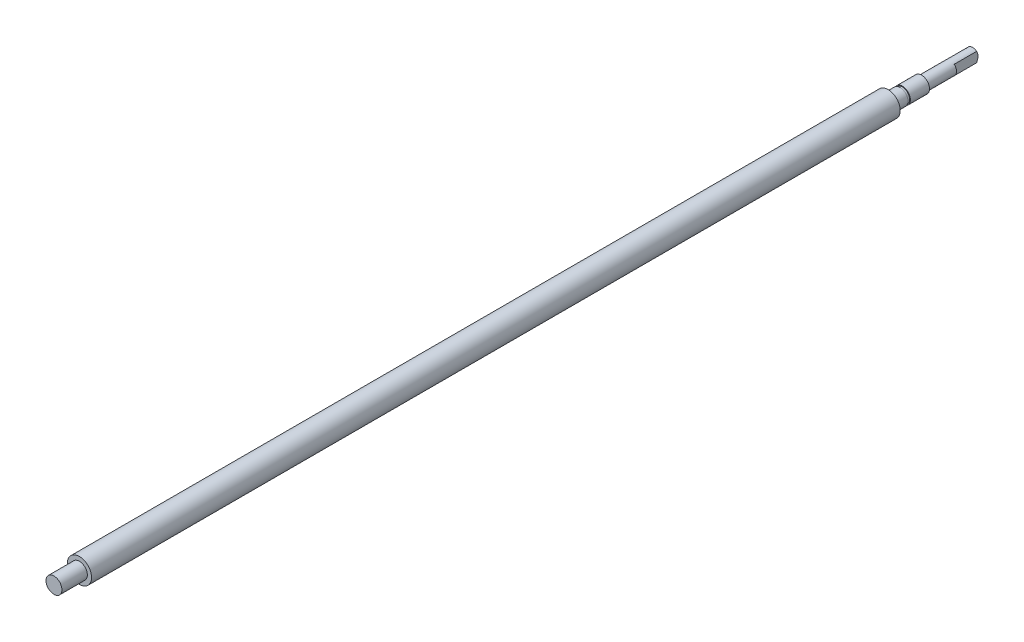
ISO-10303-21;
HEADER;
FILE_DESCRIPTION(('STEP AP214'),'2;1');
FILE_NAME('part.step','',(''),(''),'','','');
FILE_SCHEMA(('AUTOMOTIVE_DESIGN { 1 0 10303 214 1 1 1 1 }'));
ENDSEC;
DATA;
#1=APPLICATION_CONTEXT('core data for automotive mechanical design processes');
#2=APPLICATION_PROTOCOL_DEFINITION('international standard','automotive_design',2000,#1);
#3=PRODUCT_CONTEXT('',#1,'mechanical');
#4=PRODUCT('Part','Part','',(#3));
#5=PRODUCT_RELATED_PRODUCT_CATEGORY('part','',(#4));
#6=PRODUCT_DEFINITION_FORMATION('','',#4);
#7=PRODUCT_DEFINITION_CONTEXT('part definition',#1,'design');
#8=PRODUCT_DEFINITION('design','',#6,#7);
#9=PRODUCT_DEFINITION_SHAPE('','',#8);
#10=(LENGTH_UNIT() NAMED_UNIT(*) SI_UNIT(.MILLI.,.METRE.));
#11=(NAMED_UNIT(*) PLANE_ANGLE_UNIT() SI_UNIT($,.RADIAN.));
#12=(NAMED_UNIT(*) SI_UNIT($,.STERADIAN.) SOLID_ANGLE_UNIT());
#13=UNCERTAINTY_MEASURE_WITH_UNIT(LENGTH_MEASURE(1.E-05),#10,'distance_accuracy_value','');
#14=(GEOMETRIC_REPRESENTATION_CONTEXT(3) GLOBAL_UNCERTAINTY_ASSIGNED_CONTEXT((#13)) GLOBAL_UNIT_ASSIGNED_CONTEXT((#10,
#11,#12)) REPRESENTATION_CONTEXT('',''));
#15=CARTESIAN_POINT('',(0.,0.,0.));
#16=DIRECTION('',(0.,0.,1.));
#17=DIRECTION('',(1.,0.,0.));
#18=AXIS2_PLACEMENT_3D('',#15,#16,#17);
#19=CARTESIAN_POINT('',(0.,0.,-21.5));
#20=DIRECTION('',(0.,0.,-1.));
#21=DIRECTION('',(-1.,0.,0.));
#22=AXIS2_PLACEMENT_3D('',#19,#20,#21);
#23=PLANE('',#22);
#24=CARTESIAN_POINT('',(0.,0.,-21.5));
#25=DIRECTION('',(0.,0.,-1.));
#26=DIRECTION('',(-1.,0.,0.));
#27=AXIS2_PLACEMENT_3D('',#24,#25,#26);
#28=CIRCLE('',#27,4.13397459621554);
#29=CARTESIAN_POINT('',(-4.13397459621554,0.,-21.5));
#30=VERTEX_POINT('',#29);
#31=EDGE_CURVE('E123',#30,#30,#28,.T.);
#32=ORIENTED_EDGE('',*,*,#31,.T.);
#33=EDGE_LOOP('',(#32));
#34=FACE_BOUND('',#33,.T.);
#35=CARTESIAN_POINT('',(0.,0.,-21.5));
#36=DIRECTION('',(0.,0.,-1.));
#37=DIRECTION('',(-1.,0.,0.));
#38=AXIS2_PLACEMENT_3D('',#35,#36,#37);
#39=CIRCLE('',#38,4.);
#40=CARTESIAN_POINT('',(-4.,0.,-21.5));
#41=VERTEX_POINT('',#40);
#42=EDGE_CURVE('E93',#41,#41,#39,.T.);
#43=ORIENTED_EDGE('',*,*,#42,.F.);
#44=EDGE_LOOP('',(#43));
#45=FACE_BOUND('',#44,.T.);
#46=ADVANCED_FACE('F29',(#34,#45),#23,.T.);
#47=CARTESIAN_POINT('',(0.,0.,-7.5));
#48=DIRECTION('',(0.,0.,-1.));
#49=DIRECTION('',(-1.,0.,0.));
#50=AXIS2_PLACEMENT_3D('',#47,#48,#49);
#51=PLANE('',#50);
#52=CARTESIAN_POINT('',(0.,0.,-7.5));
#53=DIRECTION('',(0.,0.,-1.));
#54=DIRECTION('',(-1.,0.,0.));
#55=AXIS2_PLACEMENT_3D('',#52,#53,#54);
#56=CIRCLE('',#55,5.);
#57=CARTESIAN_POINT('',(-5.,0.,-7.5));
#58=VERTEX_POINT('',#57);
#59=EDGE_CURVE('E105',#58,#58,#56,.T.);
#60=ORIENTED_EDGE('',*,*,#59,.T.);
#61=EDGE_LOOP('',(#60));
#62=FACE_BOUND('',#61,.T.);
#63=CARTESIAN_POINT('',(0.,0.,-7.5));
#64=DIRECTION('',(0.,0.,-1.));
#65=DIRECTION('',(-1.,0.,0.));
#66=AXIS2_PLACEMENT_3D('',#63,#64,#65);
#67=CIRCLE('',#66,4.5);
#68=CARTESIAN_POINT('',(-4.5,0.,-7.5));
#69=VERTEX_POINT('',#68);
#70=EDGE_CURVE('E99',#69,#69,#67,.T.);
#71=ORIENTED_EDGE('',*,*,#70,.F.);
#72=EDGE_LOOP('',(#71));
#73=FACE_BOUND('',#72,.T.);
#74=ADVANCED_FACE('F167',(#62,#73),#51,.T.);
#75=CARTESIAN_POINT('',(0.,0.,0.));
#76=DIRECTION('',(0.,0.,1.));
#77=DIRECTION('',(1.,0.,0.));
#78=AXIS2_PLACEMENT_3D('',#75,#76,#77);
#79=PLANE('',#78);
#80=CARTESIAN_POINT('',(0.,0.,0.));
#81=DIRECTION('',(0.,0.,1.));
#82=DIRECTION('',(1.,0.,0.));
#83=AXIS2_PLACEMENT_3D('',#80,#81,#82);
#84=CIRCLE('',#83,7.62);
#85=CARTESIAN_POINT('',(7.62,0.,0.));
#86=VERTEX_POINT('',#85);
#87=EDGE_CURVE('E114',#86,#86,#84,.T.);
#88=ORIENTED_EDGE('',*,*,#87,.F.);
#89=EDGE_LOOP('',(#88));
#90=FACE_BOUND('',#89,.T.);
#91=CARTESIAN_POINT('',(0.,0.,0.));
#92=DIRECTION('',(0.,0.,1.));
#93=DIRECTION('',(1.,0.,0.));
#94=AXIS2_PLACEMENT_3D('',#91,#92,#93);
#95=CIRCLE('',#94,5.);
#96=CARTESIAN_POINT('',(5.,0.,0.));
#97=VERTEX_POINT('',#96);
#98=EDGE_CURVE('E120',#97,#97,#95,.F.);
#99=ORIENTED_EDGE('',*,*,#98,.F.);
#100=EDGE_LOOP('',(#99));
#101=FACE_BOUND('',#100,.T.);
#102=ADVANCED_FACE('F173',(#90,#101),#79,.F.);
#103=CARTESIAN_POINT('',(0.,0.,508.));
#104=DIRECTION('',(0.,0.,1.));
#105=DIRECTION('',(1.,0.,0.));
#106=AXIS2_PLACEMENT_3D('',#103,#104,#105);
#107=PLANE('',#106);
#108=CARTESIAN_POINT('',(0.,0.,508.));
#109=DIRECTION('',(0.,0.,1.));
#110=DIRECTION('',(1.,0.,0.));
#111=AXIS2_PLACEMENT_3D('',#108,#109,#110);
#112=CIRCLE('',#111,7.62);
#113=CARTESIAN_POINT('',(7.62,0.,508.));
#114=VERTEX_POINT('',#113);
#115=EDGE_CURVE('E117',#114,#114,#112,.T.);
#116=ORIENTED_EDGE('',*,*,#115,.T.);
#117=EDGE_LOOP('',(#116));
#118=FACE_BOUND('',#117,.T.);
#119=CARTESIAN_POINT('',(0.,0.,508.));
#120=DIRECTION('',(0.,0.,1.));
#121=DIRECTION('',(1.,0.,0.));
#122=AXIS2_PLACEMENT_3D('',#119,#120,#121);
#123=CIRCLE('',#122,5.);
#124=CARTESIAN_POINT('',(5.,0.,508.));
#125=VERTEX_POINT('',#124);
#126=EDGE_CURVE('E108',#125,#125,#123,.T.);
#127=ORIENTED_EDGE('',*,*,#126,.F.);
#128=EDGE_LOOP('',(#127));
#129=FACE_BOUND('',#128,.T.);
#130=ADVANCED_FACE('F203',(#118,#129),#107,.T.);
#131=CARTESIAN_POINT('',(0.,0.,508.));
#132=DIRECTION('',(0.,0.,-1.));
#133=DIRECTION('',(-1.,0.,0.));
#134=AXIS2_PLACEMENT_3D('',#131,#132,#133);
#135=CYLINDRICAL_SURFACE('',#134,7.62);
#136=ORIENTED_EDGE('',*,*,#115,.F.);
#137=EDGE_LOOP('',(#136));
#138=FACE_BOUND('',#137,.T.);
#139=ORIENTED_EDGE('',*,*,#87,.T.);
#140=EDGE_LOOP('',(#139));
#141=FACE_BOUND('',#140,.T.);
#142=ADVANCED_FACE('F31',(#138,#141),#135,.T.);
#143=CARTESIAN_POINT('',(0.,0.,524.));
#144=DIRECTION('',(0.,0.,-1.));
#145=DIRECTION('',(-1.,0.,0.));
#146=AXIS2_PLACEMENT_3D('',#143,#144,#145);
#147=CYLINDRICAL_SURFACE('',#146,5.);
#148=CARTESIAN_POINT('',(0.,0.,524.));
#149=DIRECTION('',(0.,0.,1.));
#150=DIRECTION('',(1.,0.,0.));
#151=AXIS2_PLACEMENT_3D('',#148,#149,#150);
#152=CIRCLE('',#151,5.);
#153=CARTESIAN_POINT('',(5.,0.,524.));
#154=VERTEX_POINT('',#153);
#155=EDGE_CURVE('E111',#154,#154,#152,.T.);
#156=ORIENTED_EDGE('',*,*,#155,.F.);
#157=EDGE_LOOP('',(#156));
#158=FACE_BOUND('',#157,.T.);
#159=ORIENTED_EDGE('',*,*,#126,.T.);
#160=EDGE_LOOP('',(#159));
#161=FACE_BOUND('',#160,.T.);
#162=ADVANCED_FACE('F197',(#158,#161),#147,.T.);
#163=CARTESIAN_POINT('',(0.,0.,524.));
#164=DIRECTION('',(0.,0.,1.));
#165=DIRECTION('',(1.,0.,0.));
#166=AXIS2_PLACEMENT_3D('',#163,#164,#165);
#167=PLANE('',#166);
#168=ORIENTED_EDGE('',*,*,#155,.T.);
#169=EDGE_LOOP('',(#168));
#170=FACE_BOUND('',#169,.T.);
#171=ADVANCED_FACE('F193',(#170),#167,.T.);
#172=CARTESIAN_POINT('',(0.,0.,-7.5));
#173=DIRECTION('',(0.,0.,1.));
#174=DIRECTION('',(1.,0.,0.));
#175=AXIS2_PLACEMENT_3D('',#172,#173,#174);
#176=CYLINDRICAL_SURFACE('',#175,5.);
#177=ORIENTED_EDGE('',*,*,#59,.F.);
#178=EDGE_LOOP('',(#177));
#179=FACE_BOUND('',#178,.T.);
#180=ORIENTED_EDGE('',*,*,#98,.T.);
#181=EDGE_LOOP('',(#180));
#182=FACE_BOUND('',#181,.T.);
#183=ADVANCED_FACE('F188',(#179,#182),#176,.T.);
#184=CARTESIAN_POINT('',(0.,0.,-9.));
#185=DIRECTION('',(0.,0.,1.));
#186=DIRECTION('',(1.,0.,0.));
#187=AXIS2_PLACEMENT_3D('',#184,#185,#186);
#188=CYLINDRICAL_SURFACE('',#187,4.5);
#189=CARTESIAN_POINT('',(0.,0.,-9.));
#190=DIRECTION('',(0.,0.,-1.));
#191=DIRECTION('',(-1.,0.,0.));
#192=AXIS2_PLACEMENT_3D('',#189,#190,#191);
#193=CIRCLE('',#192,4.5);
#194=CARTESIAN_POINT('',(-4.5,0.,-9.));
#195=VERTEX_POINT('',#194);
#196=EDGE_CURVE('E102',#195,#195,#193,.T.);
#197=ORIENTED_EDGE('',*,*,#196,.F.);
#198=EDGE_LOOP('',(#197));
#199=FACE_BOUND('',#198,.T.);
#200=ORIENTED_EDGE('',*,*,#70,.T.);
#201=EDGE_LOOP('',(#200));
#202=FACE_BOUND('',#201,.T.);
#203=ADVANCED_FACE('F186',(#199,#202),#188,.T.);
#204=CARTESIAN_POINT('',(0.,0.,-9.));
#205=DIRECTION('',(0.,0.,-1.));
#206=DIRECTION('',(-1.,0.,0.));
#207=AXIS2_PLACEMENT_3D('',#204,#205,#206);
#208=PLANE('',#207);
#209=CARTESIAN_POINT('',(0.,0.,-9.));
#210=DIRECTION('',(0.,0.,-1.));
#211=DIRECTION('',(-1.,0.,0.));
#212=AXIS2_PLACEMENT_3D('',#209,#210,#211);
#213=CIRCLE('',#212,5.);
#214=CARTESIAN_POINT('',(-5.,0.,-9.));
#215=VERTEX_POINT('',#214);
#216=EDGE_CURVE('E96',#215,#215,#213,.T.);
#217=ORIENTED_EDGE('',*,*,#216,.F.);
#218=EDGE_LOOP('',(#217));
#219=FACE_BOUND('',#218,.T.);
#220=ORIENTED_EDGE('',*,*,#196,.T.);
#221=EDGE_LOOP('',(#220));
#222=FACE_BOUND('',#221,.T.);
#223=ADVANCED_FACE('F179',(#219,#222),#208,.F.);
#224=CARTESIAN_POINT('',(0.,0.,-21.5));
#225=DIRECTION('',(0.,0.,1.));
#226=DIRECTION('',(1.,0.,0.));
#227=AXIS2_PLACEMENT_3D('',#224,#225,#226);
#228=CYLINDRICAL_SURFACE('',#227,5.);
#229=CARTESIAN_POINT('',(0.,0.,-21.));
#230=DIRECTION('',(0.,0.,-1.));
#231=DIRECTION('',(-1.,0.,0.));
#232=AXIS2_PLACEMENT_3D('',#229,#230,#231);
#233=CIRCLE('',#232,5.);
#234=CARTESIAN_POINT('',(-5.,0.,-21.));
#235=VERTEX_POINT('',#234);
#236=EDGE_CURVE('E126',#235,#235,#233,.F.);
#237=ORIENTED_EDGE('',*,*,#236,.T.);
#238=EDGE_LOOP('',(#237));
#239=FACE_BOUND('',#238,.T.);
#240=ORIENTED_EDGE('',*,*,#216,.T.);
#241=EDGE_LOOP('',(#240));
#242=FACE_BOUND('',#241,.T.);
#243=ADVANCED_FACE('F181',(#239,#242),#228,.T.);
#244=CARTESIAN_POINT('',(0.,0.,-21.5));
#245=DIRECTION('',(0.,0.,1.));
#246=DIRECTION('',(1.,0.,0.));
#247=AXIS2_PLACEMENT_3D('',#244,#245,#246);
#248=CONICAL_SURFACE('',#247,4.13397459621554,1.0471975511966);
#249=ORIENTED_EDGE('',*,*,#236,.F.);
#250=EDGE_LOOP('',(#249));
#251=FACE_BOUND('',#250,.T.);
#252=ORIENTED_EDGE('',*,*,#31,.F.);
#253=EDGE_LOOP('',(#252));
#254=FACE_BOUND('',#253,.T.);
#255=ADVANCED_FACE('F184',(#251,#254),#248,.T.);
#256=CARTESIAN_POINT('',(0.,0.,-54.));
#257=DIRECTION('',(0.,0.,1.));
#258=DIRECTION('',(1.,0.,0.));
#259=AXIS2_PLACEMENT_3D('',#256,#257,#258);
#260=CYLINDRICAL_SURFACE('',#259,4.);
#261=CARTESIAN_POINT('',(0.,0.,-53.1));
#262=DIRECTION('',(0.,0.,-1.));
#263=DIRECTION('',(-1.,0.,0.));
#264=AXIS2_PLACEMENT_3D('',#261,#262,#263);
#265=CIRCLE('',#264,4.);
#266=CARTESIAN_POINT('',(-2.50000000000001,-3.12249899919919,-53.1));
#267=VERTEX_POINT('',#266);
#268=CARTESIAN_POINT('',(2.5,-3.1224989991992,-53.1));
#269=VERTEX_POINT('',#268);
#270=EDGE_CURVE('E82',#267,#269,#265,.F.);
#271=ORIENTED_EDGE('',*,*,#270,.T.);
#272=DIRECTION('',(0.,0.,1.));
#273=VECTOR('',#272,1.);
#274=CARTESIAN_POINT('',(2.5,-3.1224989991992,-54.));
#275=LINE('',#274,#273);
#276=CARTESIAN_POINT('',(2.5,-3.1224989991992,-39.));
#277=VERTEX_POINT('',#276);
#278=EDGE_CURVE('E44',#269,#277,#275,.T.);
#279=ORIENTED_EDGE('',*,*,#278,.T.);
#280=CARTESIAN_POINT('',(0.,0.,-39.));
#281=DIRECTION('',(0.,0.,-1.));
#282=DIRECTION('',(-1.,0.,0.));
#283=AXIS2_PLACEMENT_3D('',#280,#281,#282);
#284=CIRCLE('',#283,4.);
#285=CARTESIAN_POINT('',(2.5,3.1224989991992,-39.));
#286=VERTEX_POINT('',#285);
#287=EDGE_CURVE('E11',#286,#277,#284,.T.);
#288=ORIENTED_EDGE('',*,*,#287,.F.);
#289=DIRECTION('',(0.,0.,1.));
#290=VECTOR('',#289,1.);
#291=CARTESIAN_POINT('',(2.5,3.1224989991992,-54.));
#292=LINE('',#291,#290);
#293=CARTESIAN_POINT('',(2.5,3.12249899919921,-53.1));
#294=VERTEX_POINT('',#293);
#295=EDGE_CURVE('E75',#286,#294,#292,.F.);
#296=ORIENTED_EDGE('',*,*,#295,.T.);
#297=CARTESIAN_POINT('',(-2.50000000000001,3.12249899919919,-53.1));
#298=VERTEX_POINT('',#297);
#299=EDGE_CURVE('E52',#294,#298,#265,.F.);
#300=ORIENTED_EDGE('',*,*,#299,.T.);
#301=DIRECTION('',(0.,0.,1.));
#302=VECTOR('',#301,1.);
#303=CARTESIAN_POINT('',(-2.50000000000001,3.12249899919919,-54.));
#304=LINE('',#303,#302);
#305=CARTESIAN_POINT('',(-2.50000000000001,3.12249899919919,-39.));
#306=VERTEX_POINT('',#305);
#307=EDGE_CURVE('E91',#298,#306,#304,.T.);
#308=ORIENTED_EDGE('',*,*,#307,.T.);
#309=CARTESIAN_POINT('',(0.,0.,-39.));
#310=DIRECTION('',(0.,0.,1.));
#311=DIRECTION('',(1.,0.,0.));
#312=AXIS2_PLACEMENT_3D('',#309,#310,#311);
#313=CIRCLE('',#312,4.);
#314=CARTESIAN_POINT('',(-2.50000000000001,-3.12249899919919,-39.));
#315=VERTEX_POINT('',#314);
#316=EDGE_CURVE('E140',#306,#315,#313,.T.);
#317=ORIENTED_EDGE('',*,*,#316,.T.);
#318=DIRECTION('',(0.,0.,1.));
#319=VECTOR('',#318,1.);
#320=CARTESIAN_POINT('',(-2.50000000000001,-3.12249899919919,-54.));
#321=LINE('',#320,#319);
#322=EDGE_CURVE('E86',#315,#267,#321,.F.);
#323=ORIENTED_EDGE('',*,*,#322,.T.);
#324=EDGE_LOOP('',(#271,#279,#288,#296,#300,#308,#317,#323));
#325=FACE_BOUND('',#324,.T.);
#326=ORIENTED_EDGE('',*,*,#42,.T.);
#327=EDGE_LOOP('',(#326));
#328=FACE_BOUND('',#327,.T.);
#329=ADVANCED_FACE('F78',(#325,#328),#260,.T.);
#330=CARTESIAN_POINT('',(0.,0.,-54.));
#331=DIRECTION('',(0.,0.,-1.));
#332=DIRECTION('',(-1.,0.,0.));
#333=AXIS2_PLACEMENT_3D('',#330,#331,#332);
#334=PLANE('',#333);
#335=CARTESIAN_POINT('',(0.,0.,-54.));
#336=DIRECTION('',(0.,0.,-1.));
#337=DIRECTION('',(-1.,0.,0.));
#338=AXIS2_PLACEMENT_3D('',#335,#336,#337);
#339=CIRCLE('',#338,2.44115427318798);
#340=CARTESIAN_POINT('',(-2.44115427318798,0.,-54.));
#341=VERTEX_POINT('',#340);
#342=EDGE_CURVE('E129',#341,#341,#339,.T.);
#343=ORIENTED_EDGE('',*,*,#342,.T.);
#344=EDGE_LOOP('',(#343));
#345=FACE_BOUND('',#344,.T.);
#346=ADVANCED_FACE('F149',(#345),#334,.T.);
#347=CARTESIAN_POINT('',(0.,0.,-54.));
#348=DIRECTION('',(0.,0.,1.));
#349=DIRECTION('',(1.,0.,0.));
#350=AXIS2_PLACEMENT_3D('',#347,#348,#349);
#351=CONICAL_SURFACE('',#350,2.44115427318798,1.0471975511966);
#352=CARTESIAN_POINT('',(2.5,-7.17801207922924,-51.0210127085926));
#353=CARTESIAN_POINT('',(2.5,-7.01960660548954,-51.1073732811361));
#354=CARTESIAN_POINT('',(2.5,-6.8610759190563,-51.1935052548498));
#355=CARTESIAN_POINT('',(2.5,-6.5436991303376,-51.3651920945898));
#356=CARTESIAN_POINT('',(2.5,-6.38485302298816,-51.4507469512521));
#357=CARTESIAN_POINT('',(2.5,-6.06667920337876,-51.6212138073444));
#358=CARTESIAN_POINT('',(2.5,-5.90735124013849,-51.7061253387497));
#359=CARTESIAN_POINT('',(2.5,-5.58823537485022,-51.8750779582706));
#360=CARTESIAN_POINT('',(2.5,-5.42844747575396,-51.9591190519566));
#361=CARTESIAN_POINT('',(2.5,-5.10267573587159,-52.1290429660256));
#362=CARTESIAN_POINT('',(2.5,-4.93667148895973,-52.214886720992));
#363=CARTESIAN_POINT('',(2.5,-4.60389113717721,-52.3850641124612));
#364=CARTESIAN_POINT('',(2.5,-4.43711503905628,-52.4693977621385));
#365=CARTESIAN_POINT('',(2.5,-4.1026187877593,-52.6360558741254));
#366=CARTESIAN_POINT('',(2.5,-3.93489891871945,-52.7183809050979));
#367=CARTESIAN_POINT('',(2.5,-3.59817619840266,-52.8803567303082));
#368=CARTESIAN_POINT('',(2.5,-3.42917339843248,-52.9600076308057));
#369=CARTESIAN_POINT('',(2.5,-3.07673710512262,-53.1214673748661));
#370=CARTESIAN_POINT('',(2.5,-2.8931717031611,-53.2029902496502));
#371=CARTESIAN_POINT('',(2.5,-2.52332918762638,-53.3598951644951));
#372=CARTESIAN_POINT('',(2.5,-2.33705118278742,-53.4352751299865));
#373=CARTESIAN_POINT('',(2.5,-1.96292422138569,-53.5760874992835));
#374=CARTESIAN_POINT('',(2.5,-1.77511162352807,-53.6416150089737));
#375=CARTESIAN_POINT('',(2.5,-1.39522666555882,-53.7590470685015));
#376=CARTESIAN_POINT('',(2.5,-1.20315696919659,-53.8109598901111));
#377=CARTESIAN_POINT('',(2.5,-0.870617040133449,-53.8827933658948));
#378=CARTESIAN_POINT('',(2.5,-0.731228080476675,-53.9076222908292));
#379=CARTESIAN_POINT('',(2.5,-0.450806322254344,-53.9448574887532));
#380=CARTESIAN_POINT('',(2.5,-0.309774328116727,-53.957269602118));
#381=CARTESIAN_POINT('',(2.5,-0.0273027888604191,-53.9682287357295));
#382=CARTESIAN_POINT('',(2.5,0.114136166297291,-53.9667904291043));
#383=CARTESIAN_POINT('',(2.5,0.396213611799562,-53.9502618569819));
#384=CARTESIAN_POINT('',(2.5,0.536851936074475,-53.9351688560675));
#385=CARTESIAN_POINT('',(2.5,0.80433122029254,-53.8948403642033));
#386=CARTESIAN_POINT('',(2.5,0.931324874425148,-53.8705809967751));
#387=CARTESIAN_POINT('',(2.5,1.18349644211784,-53.8138701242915));
#388=CARTESIAN_POINT('',(2.5,1.30867347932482,-53.7814147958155));
#389=CARTESIAN_POINT('',(2.5,1.55741098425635,-53.7100039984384));
#390=CARTESIAN_POINT('',(2.5,1.6809675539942,-53.6710351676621));
#391=CARTESIAN_POINT('',(2.5,1.92636924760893,-53.5881378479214));
#392=CARTESIAN_POINT('',(2.5,2.04821458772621,-53.544209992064));
#393=CARTESIAN_POINT('',(2.5,2.29373592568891,-53.4513070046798));
#394=CARTESIAN_POINT('',(2.5,2.41737207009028,-53.4022273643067));
#395=CARTESIAN_POINT('',(2.5,2.66337428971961,-53.30099530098));
#396=CARTESIAN_POINT('',(2.5,2.78574034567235,-53.2488428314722));
#397=CARTESIAN_POINT('',(2.5,3.02926997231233,-53.1422305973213));
#398=CARTESIAN_POINT('',(2.5,3.1504348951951,-53.0877739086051));
#399=CARTESIAN_POINT('',(2.5,3.3919065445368,-52.9770042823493));
#400=CARTESIAN_POINT('',(2.5,3.5122132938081,-52.9206913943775));
#401=CARTESIAN_POINT('',(2.5,3.78187057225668,-52.7924482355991));
#402=CARTESIAN_POINT('',(2.5,3.93102574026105,-52.7201078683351));
#403=CARTESIAN_POINT('',(2.5,4.22847560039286,-52.5736765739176));
#404=CARTESIAN_POINT('',(2.5,4.37677027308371,-52.4995856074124));
#405=CARTESIAN_POINT('',(2.5,4.82065729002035,-52.2752833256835));
#406=CARTESIAN_POINT('',(2.5,5.11522890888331,-52.1230540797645));
#407=CARTESIAN_POINT('',(2.5,5.70267579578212,-51.8151700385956));
#408=CARTESIAN_POINT('',(2.5,5.99555053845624,-51.6595142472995));
#409=CARTESIAN_POINT('',(2.5,6.58005866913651,-51.3459244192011));
#410=CARTESIAN_POINT('',(2.5,6.87169211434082,-51.1879904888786));
#411=CARTESIAN_POINT('',(2.5,7.45446989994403,-50.8703147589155));
#412=CARTESIAN_POINT('',(2.5,7.7456130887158,-50.7105708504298));
#413=CARTESIAN_POINT('',(2.5,8.3272576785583,-50.3899122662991));
#414=CARTESIAN_POINT('',(2.5,8.61775907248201,-50.2289975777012));
#415=CARTESIAN_POINT('',(2.5,9.48844628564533,-49.7450167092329));
#416=CARTESIAN_POINT('',(2.5,10.0679140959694,-49.4206594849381));
#417=CARTESIAN_POINT('',(2.5,11.1350721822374,-48.8208337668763));
#418=CARTESIAN_POINT('',(2.5,11.6229289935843,-48.5456608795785));
#419=CARTESIAN_POINT('',(2.5,12.5980893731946,-47.9942789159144));
#420=CARTESIAN_POINT('',(2.5,13.0853929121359,-47.7180697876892));
#421=CARTESIAN_POINT('',(2.5,14.058681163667,-47.1654386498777));
#422=CARTESIAN_POINT('',(2.5,14.5446666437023,-46.8890179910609));
#423=CARTESIAN_POINT('',(2.5,15.5162982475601,-46.3356411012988));
#424=CARTESIAN_POINT('',(2.5,16.0019443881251,-46.0586848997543));
#425=CARTESIAN_POINT('',(2.5,16.4874829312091,-45.7815405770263));
#426=B_SPLINE_CURVE_WITH_KNOTS('',3,(#352,#353,#354,#355,#356,#357,#358,#359,#360,#361,#362,
#363,#364,#365,#366,#367,#368,#369,#370,#371,#372,#373,#374,#375,#376,#377,#378,#379,#380,#381,
#382,#383,#384,#385,#386,#387,#388,#389,#390,#391,#392,#393,#394,#395,#396,#397,#398,#399,#400,
#401,#402,#403,#404,#405,#406,#407,#408,#409,#410,#411,#412,#413,#414,#415,#416,#417,#418,#419,
#420,#421,#422,#423,#424,#425),.UNSPECIFIED.,.F.,.F.,(4,2,2,2,2,2,2,2,2,2,2,2,2,2,2,2,2,2,2,2,2,
2,2,2,2,2,2,2,2,2,2,2,2,2,2,2,4),(0.,0.54125281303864,1.08251438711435,1.62413782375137,
2.1657577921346,2.72641136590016,3.28706004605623,3.84754811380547,4.40801388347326,
5.0105018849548,5.61319252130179,6.20962924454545,6.80570275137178,7.22999719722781,
7.65409197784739,8.07773752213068,8.50146795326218,8.88901582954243,9.27674483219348,
9.66527921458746,10.0537640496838,10.4527751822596,10.8517923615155,11.2502927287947,
11.6487824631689,12.1460829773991,12.6433946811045,13.6380971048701,14.6330925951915,
15.6280417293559,16.6243025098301,17.6205743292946,19.6127794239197,21.293111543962,
22.9735289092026,24.6508217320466,26.3280249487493),.UNSPECIFIED.);
#427=EDGE_CURVE('E37',#269,#294,#426,.T.);
#428=ORIENTED_EDGE('',*,*,#427,.F.);
#429=ORIENTED_EDGE('',*,*,#270,.F.);
#430=CARTESIAN_POINT('',(-2.50000000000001,-7.17801207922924,-51.0210127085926));
#431=CARTESIAN_POINT('',(-2.50000000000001,-7.01960660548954,-51.1073732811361));
#432=CARTESIAN_POINT('',(-2.50000000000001,-6.8610759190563,-51.1935052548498));
#433=CARTESIAN_POINT('',(-2.50000000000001,-6.5436991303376,-51.3651920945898));
#434=CARTESIAN_POINT('',(-2.50000000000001,-6.38485302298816,-51.4507469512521));
#435=CARTESIAN_POINT('',(-2.50000000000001,-6.06667920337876,-51.6212138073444));
#436=CARTESIAN_POINT('',(-2.50000000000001,-5.90735124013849,-51.7061253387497));
#437=CARTESIAN_POINT('',(-2.50000000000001,-5.58823537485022,-51.8750779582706));
#438=CARTESIAN_POINT('',(-2.50000000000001,-5.42844747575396,-51.9591190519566));
#439=CARTESIAN_POINT('',(-2.50000000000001,-5.10267573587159,-52.1290429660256));
#440=CARTESIAN_POINT('',(-2.50000000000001,-4.93667148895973,-52.214886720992));
#441=CARTESIAN_POINT('',(-2.50000000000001,-4.60389113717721,-52.3850641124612));
#442=CARTESIAN_POINT('',(-2.50000000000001,-4.43711503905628,-52.4693977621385));
#443=CARTESIAN_POINT('',(-2.50000000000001,-4.1026187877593,-52.6360558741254));
#444=CARTESIAN_POINT('',(-2.50000000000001,-3.93489891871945,-52.7183809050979));
#445=CARTESIAN_POINT('',(-2.50000000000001,-3.59817619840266,-52.8803567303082));
#446=CARTESIAN_POINT('',(-2.50000000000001,-3.42917339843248,-52.9600076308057));
#447=CARTESIAN_POINT('',(-2.50000000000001,-3.07673710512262,-53.1214673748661));
#448=CARTESIAN_POINT('',(-2.50000000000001,-2.8931717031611,-53.2029902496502));
#449=CARTESIAN_POINT('',(-2.50000000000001,-2.52332918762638,-53.3598951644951));
#450=CARTESIAN_POINT('',(-2.50000000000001,-2.33705118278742,-53.4352751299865));
#451=CARTESIAN_POINT('',(-2.50000000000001,-1.96292422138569,-53.5760874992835));
#452=CARTESIAN_POINT('',(-2.50000000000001,-1.77511162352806,-53.6416150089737));
#453=CARTESIAN_POINT('',(-2.50000000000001,-1.39522666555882,-53.7590470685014));
#454=CARTESIAN_POINT('',(-2.50000000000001,-1.20315696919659,-53.8109598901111));
#455=CARTESIAN_POINT('',(-2.50000000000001,-0.870617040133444,-53.8827933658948));
#456=CARTESIAN_POINT('',(-2.50000000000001,-0.73122808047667,-53.9076222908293));
#457=CARTESIAN_POINT('',(-2.50000000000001,-0.450806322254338,-53.9448574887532));
#458=CARTESIAN_POINT('',(-2.50000000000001,-0.30977432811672,-53.957269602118));
#459=CARTESIAN_POINT('',(-2.50000000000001,-0.0273027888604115,-53.9682287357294));
#460=CARTESIAN_POINT('',(-2.50000000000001,0.114136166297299,-53.9667904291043));
#461=CARTESIAN_POINT('',(-2.50000000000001,0.396213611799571,-53.9502618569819));
#462=CARTESIAN_POINT('',(-2.50000000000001,0.536851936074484,-53.9351688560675));
#463=CARTESIAN_POINT('',(-2.50000000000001,0.804331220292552,-53.8948403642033));
#464=CARTESIAN_POINT('',(-2.50000000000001,0.931324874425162,-53.8705809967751));
#465=CARTESIAN_POINT('',(-2.50000000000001,1.18349644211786,-53.8138701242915));
#466=CARTESIAN_POINT('',(-2.50000000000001,1.30867347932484,-53.7814147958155));
#467=CARTESIAN_POINT('',(-2.50000000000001,1.55741098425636,-53.7100039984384));
#468=CARTESIAN_POINT('',(-2.50000000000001,1.68096755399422,-53.6710351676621));
#469=CARTESIAN_POINT('',(-2.50000000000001,1.92636924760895,-53.5881378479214));
#470=CARTESIAN_POINT('',(-2.50000000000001,2.04821458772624,-53.544209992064));
#471=CARTESIAN_POINT('',(-2.50000000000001,2.29373592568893,-53.4513070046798));
#472=CARTESIAN_POINT('',(-2.50000000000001,2.4173720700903,-53.4022273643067));
#473=CARTESIAN_POINT('',(-2.50000000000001,2.66337428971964,-53.30099530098));
#474=CARTESIAN_POINT('',(-2.50000000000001,2.78574034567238,-53.2488428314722));
#475=CARTESIAN_POINT('',(-2.50000000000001,3.02926997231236,-53.1422305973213));
#476=CARTESIAN_POINT('',(-2.50000000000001,3.15043489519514,-53.087773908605));
#477=CARTESIAN_POINT('',(-2.50000000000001,3.39190654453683,-52.9770042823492));
#478=CARTESIAN_POINT('',(-2.50000000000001,3.51221329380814,-52.9206913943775));
#479=CARTESIAN_POINT('',(-2.50000000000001,3.78187057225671,-52.7924482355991));
#480=CARTESIAN_POINT('',(-2.50000000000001,3.93102574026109,-52.7201078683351));
#481=CARTESIAN_POINT('',(-2.50000000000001,4.2284756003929,-52.5736765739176));
#482=CARTESIAN_POINT('',(-2.50000000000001,4.37677027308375,-52.4995856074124));
#483=CARTESIAN_POINT('',(-2.50000000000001,4.82065729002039,-52.2752833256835));
#484=CARTESIAN_POINT('',(-2.5,5.11522890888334,-52.1230540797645));
#485=CARTESIAN_POINT('',(-2.5,5.70267579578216,-51.8151700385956));
#486=CARTESIAN_POINT('',(-2.5,5.99555053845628,-51.6595142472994));
#487=CARTESIAN_POINT('',(-2.5,6.58005866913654,-51.345924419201));
#488=CARTESIAN_POINT('',(-2.5,6.87169211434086,-51.1879904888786));
#489=CARTESIAN_POINT('',(-2.5,7.45446989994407,-50.8703147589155));
#490=CARTESIAN_POINT('',(-2.5,7.74561308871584,-50.7105708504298));
#491=CARTESIAN_POINT('',(-2.5,8.32725767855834,-50.3899122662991));
#492=CARTESIAN_POINT('',(-2.5,8.61775907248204,-50.2289975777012));
#493=CARTESIAN_POINT('',(-2.5,9.48844628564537,-49.7450167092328));
#494=CARTESIAN_POINT('',(-2.5,10.0679140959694,-49.4206594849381));
#495=CARTESIAN_POINT('',(-2.5,11.1350721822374,-48.8208337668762));
#496=CARTESIAN_POINT('',(-2.5,11.6229289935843,-48.5456608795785));
#497=CARTESIAN_POINT('',(-2.5,12.5980893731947,-47.9942789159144));
#498=CARTESIAN_POINT('',(-2.5,13.0853929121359,-47.7180697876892));
#499=CARTESIAN_POINT('',(-2.5,14.058681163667,-47.1654386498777));
#500=CARTESIAN_POINT('',(-2.5,14.5446666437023,-46.8890179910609));
#501=CARTESIAN_POINT('',(-2.5,15.5162982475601,-46.3356411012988));
#502=CARTESIAN_POINT('',(-2.5,16.0019443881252,-46.0586848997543));
#503=CARTESIAN_POINT('',(-2.5,16.4874829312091,-45.7815405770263));
#504=B_SPLINE_CURVE_WITH_KNOTS('',3,(#430,#431,#432,#433,#434,#435,#436,#437,#438,#439,#440,
#441,#442,#443,#444,#445,#446,#447,#448,#449,#450,#451,#452,#453,#454,#455,#456,#457,#458,#459,
#460,#461,#462,#463,#464,#465,#466,#467,#468,#469,#470,#471,#472,#473,#474,#475,#476,#477,#478,
#479,#480,#481,#482,#483,#484,#485,#486,#487,#488,#489,#490,#491,#492,#493,#494,#495,#496,#497,
#498,#499,#500,#501,#502,#503),.UNSPECIFIED.,.F.,.F.,(4,2,2,2,2,2,2,2,2,2,2,2,2,2,2,2,2,2,2,2,2,
2,2,2,2,2,2,2,2,2,2,2,2,2,2,2,4),(0.,0.541252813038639,1.08251438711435,1.62413782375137,
2.16575779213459,2.72641136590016,3.28706004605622,3.84754811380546,4.40801388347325,
5.0105018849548,5.61319252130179,6.20962924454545,6.80570275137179,7.22999719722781,
7.65409197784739,8.07773752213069,8.50146795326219,8.88901582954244,9.2767448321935,
9.66527921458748,10.0537640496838,10.4527751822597,10.8517923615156,11.2502927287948,
11.6487824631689,12.1460829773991,12.6433946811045,13.6380971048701,14.6330925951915,
15.6280417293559,16.6243025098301,17.6205743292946,19.6127794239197,21.2931115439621,
22.9735289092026,24.6508217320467,26.3280249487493),.UNSPECIFIED.);
#505=EDGE_CURVE('E133',#298,#267,#504,.F.);
#506=ORIENTED_EDGE('',*,*,#505,.F.);
#507=ORIENTED_EDGE('',*,*,#299,.F.);
#508=EDGE_LOOP('',(#428,#429,#506,#507));
#509=FACE_BOUND('',#508,.T.);
#510=ORIENTED_EDGE('',*,*,#342,.F.);
#511=EDGE_LOOP('',(#510));
#512=FACE_BOUND('',#511,.T.);
#513=ADVANCED_FACE('F144',(#509,#512),#351,.T.);
#514=CARTESIAN_POINT('',(-6.50000000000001,-6.5,-39.));
#515=DIRECTION('',(0.,0.,1.));
#516=DIRECTION('',(1.,0.,0.));
#517=AXIS2_PLACEMENT_3D('',#514,#515,#516);
#518=PLANE('',#517);
#519=DIRECTION('',(0.,-1.,0.));
#520=VECTOR('',#519,1.);
#521=CARTESIAN_POINT('',(-2.50000000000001,-6.5,-39.));
#522=LINE('',#521,#520);
#523=EDGE_CURVE('E83',#306,#315,#522,.T.);
#524=ORIENTED_EDGE('',*,*,#523,.T.);
#525=ORIENTED_EDGE('',*,*,#316,.F.);
#526=EDGE_LOOP('',(#524,#525));
#527=FACE_BOUND('',#526,.T.);
#528=ADVANCED_FACE('F148',(#527),#518,.F.);
#529=CARTESIAN_POINT('',(-2.50000000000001,-6.5,-39.));
#530=DIRECTION('',(1.,0.,0.));
#531=DIRECTION('',(0.,1.,0.));
#532=AXIS2_PLACEMENT_3D('',#529,#530,#531);
#533=PLANE('',#532);
#534=ORIENTED_EDGE('',*,*,#505,.T.);
#535=ORIENTED_EDGE('',*,*,#322,.F.);
#536=ORIENTED_EDGE('',*,*,#523,.F.);
#537=ORIENTED_EDGE('',*,*,#307,.F.);
#538=EDGE_LOOP('',(#534,#535,#536,#537));
#539=FACE_BOUND('',#538,.T.);
#540=ADVANCED_FACE('F141',(#539),#533,.F.);
#541=CARTESIAN_POINT('',(6.5,6.5,-39.));
#542=DIRECTION('',(0.,0.,-1.));
#543=DIRECTION('',(-1.,0.,0.));
#544=AXIS2_PLACEMENT_3D('',#541,#542,#543);
#545=PLANE('',#544);
#546=ORIENTED_EDGE('',*,*,#287,.T.);
#547=DIRECTION('',(0.,1.,0.));
#548=VECTOR('',#547,1.);
#549=CARTESIAN_POINT('',(2.5,-6.5,-39.));
#550=LINE('',#549,#548);
#551=EDGE_CURVE('E73',#277,#286,#550,.T.);
#552=ORIENTED_EDGE('',*,*,#551,.T.);
#553=EDGE_LOOP('',(#546,#552));
#554=FACE_BOUND('',#553,.T.);
#555=ADVANCED_FACE('F72',(#554),#545,.T.);
#556=CARTESIAN_POINT('',(2.5,-6.5,-39.));
#557=DIRECTION('',(-1.,0.,0.));
#558=DIRECTION('',(0.,0.,1.));
#559=AXIS2_PLACEMENT_3D('',#556,#557,#558);
#560=PLANE('',#559);
#561=ORIENTED_EDGE('',*,*,#427,.T.);
#562=ORIENTED_EDGE('',*,*,#295,.F.);
#563=ORIENTED_EDGE('',*,*,#551,.F.);
#564=ORIENTED_EDGE('',*,*,#278,.F.);
#565=EDGE_LOOP('',(#561,#562,#563,#564));
#566=FACE_BOUND('',#565,.T.);
#567=ADVANCED_FACE('F74',(#566),#560,.F.);
#568=CLOSED_SHELL('',(#46,#74,#102,#130,#142,#162,#171,#183,#203,#223,#243,#255,#329,#346,#513,
#528,#540,#555,#567));
#569=MANIFOLD_SOLID_BREP('B2',#568);
#570=ADVANCED_BREP_SHAPE_REPRESENTATION('',(#18,#569),#14);
#571=SHAPE_DEFINITION_REPRESENTATION(#9,#570);
ENDSEC;
END-ISO-10303-21;
